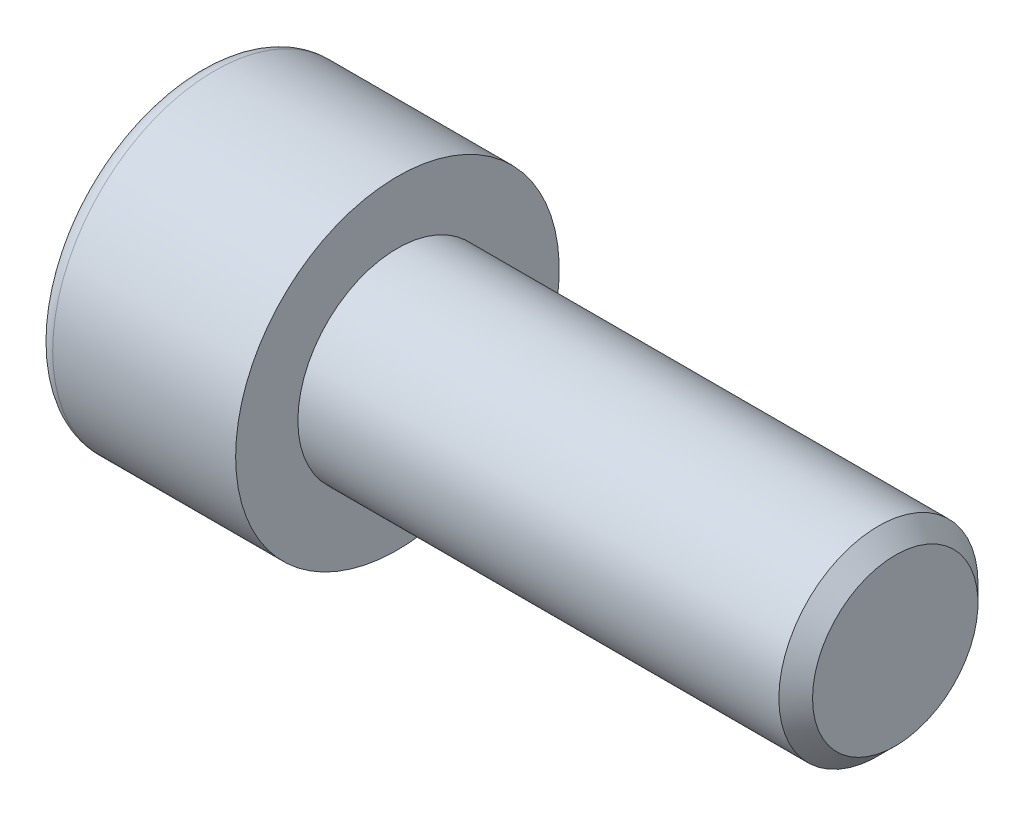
ISO-10303-21;
HEADER;
FILE_DESCRIPTION(('STEP AP214'),'2;1');
FILE_NAME('part.step','',(''),(''),'','','');
FILE_SCHEMA(('AUTOMOTIVE_DESIGN { 1 0 10303 214 1 1 1 1 }'));
ENDSEC;
DATA;
#1=APPLICATION_CONTEXT('core data for automotive mechanical design processes');
#2=APPLICATION_PROTOCOL_DEFINITION('international standard','automotive_design',2000,#1);
#3=PRODUCT_CONTEXT('',#1,'mechanical');
#4=PRODUCT('Part','Part','',(#3));
#5=PRODUCT_RELATED_PRODUCT_CATEGORY('part','',(#4));
#6=PRODUCT_DEFINITION_FORMATION('','',#4);
#7=PRODUCT_DEFINITION_CONTEXT('part definition',#1,'design');
#8=PRODUCT_DEFINITION('design','',#6,#7);
#9=PRODUCT_DEFINITION_SHAPE('','',#8);
#10=(LENGTH_UNIT() NAMED_UNIT(*) SI_UNIT(.MILLI.,.METRE.));
#11=(NAMED_UNIT(*) PLANE_ANGLE_UNIT() SI_UNIT($,.RADIAN.));
#12=(NAMED_UNIT(*) SI_UNIT($,.STERADIAN.) SOLID_ANGLE_UNIT());
#13=UNCERTAINTY_MEASURE_WITH_UNIT(LENGTH_MEASURE(1.E-05),#10,'distance_accuracy_value','');
#14=(GEOMETRIC_REPRESENTATION_CONTEXT(3) GLOBAL_UNCERTAINTY_ASSIGNED_CONTEXT((#13)) GLOBAL_UNIT_ASSIGNED_CONTEXT((#10,
#11,#12)) REPRESENTATION_CONTEXT('',''));
#15=CARTESIAN_POINT('',(0.,0.,0.));
#16=DIRECTION('',(0.,0.,1.));
#17=DIRECTION('',(1.,0.,0.));
#18=AXIS2_PLACEMENT_3D('',#15,#16,#17);
#19=CARTESIAN_POINT('',(0.,0.,0.));
#20=DIRECTION('',(-0.999999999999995,0.,0.));
#21=DIRECTION('',(0.,0.,1.));
#22=AXIS2_PLACEMENT_3D('',#19,#20,#21);
#23=PLANE('',#22);
#24=CARTESIAN_POINT('',(0.,0.,0.));
#25=DIRECTION('',(-0.999999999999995,0.,0.));
#26=DIRECTION('',(0.,0.,1.));
#27=AXIS2_PLACEMENT_3D('',#24,#25,#26);
#28=CIRCLE('',#27,6.5);
#29=CARTESIAN_POINT('',(0.,0.,6.50000000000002));
#30=VERTEX_POINT('',#29);
#31=EDGE_CURVE('E117',#30,#30,#28,.T.);
#32=ORIENTED_EDGE('',*,*,#31,.F.);
#33=EDGE_LOOP('',(#32));
#34=FACE_BOUND('',#33,.T.);
#35=CARTESIAN_POINT('',(0.,0.,0.));
#36=DIRECTION('',(-0.999999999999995,0.,0.));
#37=DIRECTION('',(0.,0.,1.));
#38=AXIS2_PLACEMENT_3D('',#35,#36,#37);
#39=CIRCLE('',#38,4.);
#40=CARTESIAN_POINT('',(0.,0.,4.));
#41=VERTEX_POINT('',#40);
#42=EDGE_CURVE('E13',#41,#41,#39,.F.);
#43=ORIENTED_EDGE('',*,*,#42,.F.);
#44=EDGE_LOOP('',(#43));
#45=FACE_BOUND('',#44,.T.);
#46=ADVANCED_FACE('F24',(#34,#45),#23,.F.);
#47=CARTESIAN_POINT('',(-8.00000000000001,5.84999999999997,0.));
#48=DIRECTION('',(0.999999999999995,0.,0.));
#49=DIRECTION('',(0.,0.,-1.));
#50=AXIS2_PLACEMENT_3D('',#47,#48,#49);
#51=PLANE('',#50);
#52=CARTESIAN_POINT('',(-8.00000000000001,0.,0.));
#53=DIRECTION('',(-0.999999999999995,0.,0.));
#54=DIRECTION('',(0.,0.,1.));
#55=AXIS2_PLACEMENT_3D('',#52,#53,#54);
#56=CIRCLE('',#55,5.85);
#57=CARTESIAN_POINT('',(-8.00000000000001,0.,5.85000000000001));
#58=VERTEX_POINT('',#57);
#59=EDGE_CURVE('E99',#58,#58,#56,.T.);
#60=ORIENTED_EDGE('',*,*,#59,.T.);
#61=EDGE_LOOP('',(#60));
#62=FACE_BOUND('',#61,.T.);
#63=DIRECTION('',(0.,0.499999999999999,0.86602540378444));
#64=VECTOR('',#63,1.);
#65=CARTESIAN_POINT('',(-8.00000000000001,-1.13557621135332,4.0331243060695));
#66=LINE('',#65,#64);
#67=CARTESIAN_POINT('',(-8.00000000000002,-3.46410161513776,0.));
#68=VERTEX_POINT('',#67);
#69=CARTESIAN_POINT('',(-8.00000000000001,-1.73205080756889,3.00000000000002));
#70=VERTEX_POINT('',#69);
#71=EDGE_CURVE('E33',#68,#70,#66,.T.);
#72=ORIENTED_EDGE('',*,*,#71,.F.);
#73=DIRECTION('',(0.,-0.5,0.866025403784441));
#74=VECTOR('',#73,1.);
#75=CARTESIAN_POINT('',(-8.00000000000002,-1.13557621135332,-4.03312430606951));
#76=LINE('',#75,#74);
#77=CARTESIAN_POINT('',(-8.00000000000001,-1.73205080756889,-2.99999999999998));
#78=VERTEX_POINT('',#77);
#79=EDGE_CURVE('E48',#78,#68,#76,.T.);
#80=ORIENTED_EDGE('',*,*,#79,.F.);
#81=DIRECTION('',(0.,-1.,0.));
#82=VECTOR('',#81,1.);
#83=CARTESIAN_POINT('',(-8.00000000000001,5.84999999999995,-3.00000000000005));
#84=LINE('',#83,#82);
#85=CARTESIAN_POINT('',(-8.00000000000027,1.73205080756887,-3.00000000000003));
#86=VERTEX_POINT('',#85);
#87=EDGE_CURVE('E130',#86,#78,#84,.T.);
#88=ORIENTED_EDGE('',*,*,#87,.F.);
#89=DIRECTION('',(0.,-0.499999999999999,-0.866025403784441));
#90=VECTOR('',#89,1.);
#91=CARTESIAN_POINT('',(-8.00000000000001,4.0605762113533,1.03312430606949));
#92=LINE('',#91,#90);
#93=CARTESIAN_POINT('',(-8.00000000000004,3.46410161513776,0.));
#94=VERTEX_POINT('',#93);
#95=EDGE_CURVE('E127',#94,#86,#92,.T.);
#96=ORIENTED_EDGE('',*,*,#95,.F.);
#97=DIRECTION('',(0.,0.5,-0.866025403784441));
#98=VECTOR('',#97,1.);
#99=CARTESIAN_POINT('',(-8.00000000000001,4.06057621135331,-1.03312430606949));
#100=LINE('',#99,#98);
#101=CARTESIAN_POINT('',(-8.00000000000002,1.73205080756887,3.00000000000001));
#102=VERTEX_POINT('',#101);
#103=EDGE_CURVE('E124',#102,#94,#100,.T.);
#104=ORIENTED_EDGE('',*,*,#103,.F.);
#105=DIRECTION('',(0.,0.999999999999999,0.));
#106=VECTOR('',#105,1.);
#107=CARTESIAN_POINT('',(-8.00000000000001,5.84999999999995,3.00000000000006));
#108=LINE('',#107,#106);
#109=EDGE_CURVE('E121',#70,#102,#108,.T.);
#110=ORIENTED_EDGE('',*,*,#109,.F.);
#111=EDGE_LOOP('',(#72,#80,#88,#96,#104,#110));
#112=FACE_BOUND('',#111,.T.);
#113=ADVANCED_FACE('F26',(#62,#112),#51,.F.);
#114=CARTESIAN_POINT('',(-8.00000000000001,0.,0.));
#115=DIRECTION('',(-0.999999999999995,0.,0.));
#116=DIRECTION('',(0.,0.,1.));
#117=AXIS2_PLACEMENT_3D('',#114,#115,#116);
#118=CYLINDRICAL_SURFACE('',#117,6.5);
#119=CARTESIAN_POINT('',(-7.34999999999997,0.,0.));
#120=DIRECTION('',(-0.999999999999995,0.,0.));
#121=DIRECTION('',(0.,0.,1.));
#122=AXIS2_PLACEMENT_3D('',#119,#120,#121);
#123=CIRCLE('',#122,6.5);
#124=CARTESIAN_POINT('',(-7.34999999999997,0.,6.50000000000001));
#125=VERTEX_POINT('',#124);
#126=EDGE_CURVE('E107',#125,#125,#123,.T.);
#127=CARTESIAN_POINT('',(-7.34999999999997,0.,6.50000000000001));
#128=CARTESIAN_POINT('',(-7.27343749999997,0.,6.50000000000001));
#129=CARTESIAN_POINT('',(-7.19687499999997,0.,6.50000000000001));
#130=CARTESIAN_POINT('',(-7.04374999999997,0.,6.50000000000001));
#131=CARTESIAN_POINT('',(-6.96718749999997,0.,6.50000000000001));
#132=CARTESIAN_POINT('',(-6.81406249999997,0.,6.50000000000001));
#133=CARTESIAN_POINT('',(-6.73749999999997,0.,6.50000000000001));
#134=CARTESIAN_POINT('',(-6.58437499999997,0.,6.50000000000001));
#135=CARTESIAN_POINT('',(-6.50781249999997,0.,6.50000000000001));
#136=CARTESIAN_POINT('',(-6.35468749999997,0.,6.50000000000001));
#137=CARTESIAN_POINT('',(-6.27812499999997,0.,6.50000000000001));
#138=CARTESIAN_POINT('',(-6.12499999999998,0.,6.50000000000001));
#139=CARTESIAN_POINT('',(-6.04843749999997,0.,6.50000000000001));
#140=CARTESIAN_POINT('',(-5.89531249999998,0.,6.50000000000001));
#141=CARTESIAN_POINT('',(-5.81874999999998,0.,6.50000000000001));
#142=CARTESIAN_POINT('',(-5.66562499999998,0.,6.50000000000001));
#143=CARTESIAN_POINT('',(-5.58906249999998,0.,6.50000000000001));
#144=CARTESIAN_POINT('',(-5.43593749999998,0.,6.50000000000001));
#145=CARTESIAN_POINT('',(-5.35937499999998,0.,6.50000000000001));
#146=CARTESIAN_POINT('',(-5.20624999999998,0.,6.50000000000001));
#147=CARTESIAN_POINT('',(-5.12968749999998,0.,6.50000000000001));
#148=CARTESIAN_POINT('',(-4.97656249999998,0.,6.50000000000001));
#149=CARTESIAN_POINT('',(-4.89999999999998,0.,6.50000000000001));
#150=CARTESIAN_POINT('',(-4.74687499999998,0.,6.50000000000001));
#151=CARTESIAN_POINT('',(-4.67031249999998,0.,6.50000000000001));
#152=CARTESIAN_POINT('',(-4.51718749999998,0.,6.50000000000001));
#153=CARTESIAN_POINT('',(-4.44062499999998,0.,6.50000000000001));
#154=CARTESIAN_POINT('',(-4.28749999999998,0.,6.50000000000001));
#155=CARTESIAN_POINT('',(-4.21093749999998,0.,6.50000000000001));
#156=CARTESIAN_POINT('',(-4.05781249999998,0.,6.50000000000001));
#157=CARTESIAN_POINT('',(-3.98124999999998,0.,6.50000000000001));
#158=CARTESIAN_POINT('',(-3.82812499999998,0.,6.50000000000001));
#159=CARTESIAN_POINT('',(-3.75156249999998,0.,6.50000000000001));
#160=CARTESIAN_POINT('',(-3.59843749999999,0.,6.50000000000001));
#161=CARTESIAN_POINT('',(-3.52187499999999,0.,6.50000000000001));
#162=CARTESIAN_POINT('',(-3.36874999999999,0.,6.50000000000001));
#163=CARTESIAN_POINT('',(-3.29218749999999,0.,6.50000000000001));
#164=CARTESIAN_POINT('',(-3.13906249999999,0.,6.50000000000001));
#165=CARTESIAN_POINT('',(-3.06249999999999,0.,6.50000000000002));
#166=CARTESIAN_POINT('',(-2.90937499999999,0.,6.50000000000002));
#167=CARTESIAN_POINT('',(-2.83281249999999,0.,6.50000000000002));
#168=CARTESIAN_POINT('',(-2.67968749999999,0.,6.50000000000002));
#169=CARTESIAN_POINT('',(-2.60312499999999,0.,6.50000000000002));
#170=CARTESIAN_POINT('',(-2.44999999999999,0.,6.50000000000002));
#171=CARTESIAN_POINT('',(-2.37343749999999,0.,6.50000000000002));
#172=CARTESIAN_POINT('',(-2.22031249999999,0.,6.50000000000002));
#173=CARTESIAN_POINT('',(-2.14374999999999,0.,6.50000000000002));
#174=CARTESIAN_POINT('',(-1.99062499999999,0.,6.50000000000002));
#175=CARTESIAN_POINT('',(-1.91406249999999,0.,6.50000000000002));
#176=CARTESIAN_POINT('',(-1.76093749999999,0.,6.50000000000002));
#177=CARTESIAN_POINT('',(-1.68437499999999,0.,6.50000000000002));
#178=CARTESIAN_POINT('',(-1.53124999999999,0.,6.50000000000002));
#179=CARTESIAN_POINT('',(-1.4546875,0.,6.50000000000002));
#180=CARTESIAN_POINT('',(-1.3015625,0.,6.50000000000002));
#181=CARTESIAN_POINT('',(-1.225,0.,6.50000000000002));
#182=CARTESIAN_POINT('',(-1.071875,0.,6.50000000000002));
#183=CARTESIAN_POINT('',(-0.995312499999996,0.,6.50000000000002));
#184=CARTESIAN_POINT('',(-0.842187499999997,0.,6.50000000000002));
#185=CARTESIAN_POINT('',(-0.765624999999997,0.,6.50000000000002));
#186=CARTESIAN_POINT('',(-0.612499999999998,0.,6.50000000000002));
#187=CARTESIAN_POINT('',(-0.535937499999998,0.,6.50000000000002));
#188=CARTESIAN_POINT('',(-0.382812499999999,0.,6.50000000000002));
#189=CARTESIAN_POINT('',(-0.30625,0.,6.50000000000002));
#190=CARTESIAN_POINT('',(-0.153125,0.,6.50000000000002));
#191=CARTESIAN_POINT('',(-0.0765625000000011,0.,6.50000000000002));
#192=CARTESIAN_POINT('',(0.,0.,6.50000000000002));
#193=B_SPLINE_CURVE_WITH_KNOTS('',3,(#127,#128,#129,#130,#131,#132,#133,#134,#135,#136,#137,
#138,#139,#140,#141,#142,#143,#144,#145,#146,#147,#148,#149,#150,#151,#152,#153,#154,#155,#156,
#157,#158,#159,#160,#161,#162,#163,#164,#165,#166,#167,#168,#169,#170,#171,#172,#173,#174,#175,
#176,#177,#178,#179,#180,#181,#182,#183,#184,#185,#186,#187,#188,#189,#190,#191,#192),
.UNSPECIFIED.,.F.,.F.,(4,2,2,2,2,2,2,2,2,2,2,2,2,2,2,2,2,2,2,2,2,2,2,2,2,2,2,2,2,2,2,2,4),(0.,
0.229687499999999,0.459374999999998,0.689062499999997,0.918749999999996,1.14843749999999,
1.37812499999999,1.60781249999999,1.83749999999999,2.06718749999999,2.29687499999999,
2.52656249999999,2.75624999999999,2.98593749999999,3.21562499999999,3.44531249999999,
3.67499999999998,3.90468749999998,4.13437499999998,4.36406249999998,4.59374999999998,
4.82343749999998,5.05312499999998,5.28281249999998,5.51249999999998,5.74218749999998,
5.97187499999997,6.20156249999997,6.43124999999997,6.66093749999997,6.89062499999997,
7.12031249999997,7.34999999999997),.UNSPECIFIED.);
#194=EDGE_CURVE('BSEAM216',#125,#30,#193,.T.);
#195=ORIENTED_EDGE('',*,*,#126,.F.);
#196=ORIENTED_EDGE('',*,*,#31,.T.);
#197=ORIENTED_EDGE('',*,*,#194,.T.);
#198=ORIENTED_EDGE('',*,*,#194,.F.);
#199=EDGE_LOOP('',(#195,#197,#196,#198));
#200=FACE_BOUND('',#199,.T.);
#201=ADVANCED_FACE('F216',(#200),#118,.T.);
#202=CARTESIAN_POINT('',(-7.34999999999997,0.,0.));
#203=DIRECTION('',(-0.999999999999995,0.,0.));
#204=DIRECTION('',(0.,0.,1.));
#205=AXIS2_PLACEMENT_3D('',#202,#203,#204);
#206=TOROIDAL_SURFACE('',#205,5.85,0.65);
#207=ORIENTED_EDGE('',*,*,#59,.F.);
#208=EDGE_LOOP('',(#207));
#209=FACE_BOUND('',#208,.T.);
#210=ORIENTED_EDGE('',*,*,#126,.T.);
#211=EDGE_LOOP('',(#210));
#212=FACE_BOUND('',#211,.T.);
#213=ADVANCED_FACE('F223',(#209,#212),#206,.T.);
#214=CARTESIAN_POINT('',(-3.99999999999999,-1.73205080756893,3.00000000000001));
#215=DIRECTION('',(0.,0.866025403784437,-0.500000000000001));
#216=DIRECTION('',(0.,0.499999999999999,0.86602540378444));
#217=AXIS2_PLACEMENT_3D('',#214,#215,#216);
#218=PLANE('',#217);
#219=ORIENTED_EDGE('',*,*,#71,.T.);
#220=DIRECTION('',(-0.999999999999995,0.,0.));
#221=VECTOR('',#220,1.);
#222=CARTESIAN_POINT('',(-3.99999999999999,-1.73205080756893,3.00000000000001));
#223=LINE('',#222,#221);
#224=CARTESIAN_POINT('',(-3.99999999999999,-1.73205080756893,3.00000000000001));
#225=VERTEX_POINT('',#224);
#226=EDGE_CURVE('E40',#225,#70,#223,.T.);
#227=ORIENTED_EDGE('',*,*,#226,.F.);
#228=DIRECTION('',(0.,-0.499999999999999,-0.86602540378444));
#229=VECTOR('',#228,1.);
#230=CARTESIAN_POINT('',(-3.99999999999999,-1.73205080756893,3.00000000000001));
#231=LINE('',#230,#229);
#232=CARTESIAN_POINT('',(-4.00000000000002,-3.46410161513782,0.));
#233=VERTEX_POINT('',#232);
#234=EDGE_CURVE('E84',#225,#233,#231,.T.);
#235=ORIENTED_EDGE('',*,*,#234,.T.);
#236=DIRECTION('',(-0.999999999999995,0.,0.));
#237=VECTOR('',#236,1.);
#238=CARTESIAN_POINT('',(-4.00000000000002,-3.46410161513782,0.));
#239=LINE('',#238,#237);
#240=EDGE_CURVE('E92',#233,#68,#239,.T.);
#241=ORIENTED_EDGE('',*,*,#240,.T.);
#242=EDGE_LOOP('',(#219,#227,#235,#241));
#243=FACE_BOUND('',#242,.T.);
#244=ADVANCED_FACE('F91',(#243),#218,.T.);
#245=CARTESIAN_POINT('',(-4.00000000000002,-3.46410161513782,0.));
#246=DIRECTION('',(0.,0.866025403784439,0.500000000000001));
#247=DIRECTION('',(0.,-0.5,0.866025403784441));
#248=AXIS2_PLACEMENT_3D('',#245,#246,#247);
#249=PLANE('',#248);
#250=ORIENTED_EDGE('',*,*,#79,.T.);
#251=ORIENTED_EDGE('',*,*,#240,.F.);
#252=DIRECTION('',(0.,0.5,-0.866025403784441));
#253=VECTOR('',#252,1.);
#254=CARTESIAN_POINT('',(-4.00000000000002,-3.46410161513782,0.));
#255=LINE('',#254,#253);
#256=CARTESIAN_POINT('',(-4.,-1.73205080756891,-2.99999999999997));
#257=VERTEX_POINT('',#256);
#258=EDGE_CURVE('E80',#233,#257,#255,.T.);
#259=ORIENTED_EDGE('',*,*,#258,.T.);
#260=DIRECTION('',(-0.999999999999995,0.,0.));
#261=VECTOR('',#260,1.);
#262=CARTESIAN_POINT('',(-4.,-1.73205080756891,-2.99999999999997));
#263=LINE('',#262,#261);
#264=EDGE_CURVE('E100',#257,#78,#263,.T.);
#265=ORIENTED_EDGE('',*,*,#264,.T.);
#266=EDGE_LOOP('',(#250,#251,#259,#265));
#267=FACE_BOUND('',#266,.T.);
#268=ADVANCED_FACE('F97',(#267),#249,.T.);
#269=CARTESIAN_POINT('',(-4.,-1.73205080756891,-2.99999999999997));
#270=DIRECTION('',(0.,0.,1.));
#271=DIRECTION('',(0.,-1.,0.));
#272=AXIS2_PLACEMENT_3D('',#269,#270,#271);
#273=PLANE('',#272);
#274=ORIENTED_EDGE('',*,*,#87,.T.);
#275=ORIENTED_EDGE('',*,*,#264,.F.);
#276=DIRECTION('',(0.,1.,0.));
#277=VECTOR('',#276,1.);
#278=CARTESIAN_POINT('',(-4.,-1.73205080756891,-2.99999999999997));
#279=LINE('',#278,#277);
#280=CARTESIAN_POINT('',(-4.00000000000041,1.73205080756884,-3.00000000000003));
#281=VERTEX_POINT('',#280);
#282=EDGE_CURVE('E86',#257,#281,#279,.T.);
#283=ORIENTED_EDGE('',*,*,#282,.T.);
#284=DIRECTION('',(-0.999999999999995,0.,0.));
#285=VECTOR('',#284,1.);
#286=CARTESIAN_POINT('',(-4.00000000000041,1.73205080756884,-3.00000000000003));
#287=LINE('',#286,#285);
#288=EDGE_CURVE('E110',#281,#86,#287,.T.);
#289=ORIENTED_EDGE('',*,*,#288,.T.);
#290=EDGE_LOOP('',(#274,#275,#283,#289));
#291=FACE_BOUND('',#290,.T.);
#292=ADVANCED_FACE('F169',(#291),#273,.T.);
#293=CARTESIAN_POINT('',(-4.00000000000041,1.73205080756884,-3.00000000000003));
#294=DIRECTION('',(0.,-0.866025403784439,0.500000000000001));
#295=DIRECTION('',(0.,-0.499999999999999,-0.866025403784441));
#296=AXIS2_PLACEMENT_3D('',#293,#294,#295);
#297=PLANE('',#296);
#298=ORIENTED_EDGE('',*,*,#95,.T.);
#299=ORIENTED_EDGE('',*,*,#288,.F.);
#300=DIRECTION('',(0.,0.499999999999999,0.866025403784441));
#301=VECTOR('',#300,1.);
#302=CARTESIAN_POINT('',(-4.00000000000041,1.73205080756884,-3.00000000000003));
#303=LINE('',#302,#301);
#304=CARTESIAN_POINT('',(-4.00000000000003,3.46410161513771,0.));
#305=VERTEX_POINT('',#304);
#306=EDGE_CURVE('E172',#281,#305,#303,.T.);
#307=ORIENTED_EDGE('',*,*,#306,.T.);
#308=DIRECTION('',(-0.999999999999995,0.,0.));
#309=VECTOR('',#308,1.);
#310=CARTESIAN_POINT('',(-4.00000000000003,3.46410161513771,0.));
#311=LINE('',#310,#309);
#312=EDGE_CURVE('E151',#305,#94,#311,.T.);
#313=ORIENTED_EDGE('',*,*,#312,.T.);
#314=EDGE_LOOP('',(#298,#299,#307,#313));
#315=FACE_BOUND('',#314,.T.);
#316=ADVANCED_FACE('F171',(#315),#297,.T.);
#317=CARTESIAN_POINT('',(-4.00000000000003,3.46410161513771,0.));
#318=DIRECTION('',(0.,-0.866025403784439,-0.500000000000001));
#319=DIRECTION('',(0.,0.5,-0.866025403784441));
#320=AXIS2_PLACEMENT_3D('',#317,#318,#319);
#321=PLANE('',#320);
#322=ORIENTED_EDGE('',*,*,#103,.T.);
#323=ORIENTED_EDGE('',*,*,#312,.F.);
#324=DIRECTION('',(0.,-0.5,0.866025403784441));
#325=VECTOR('',#324,1.);
#326=CARTESIAN_POINT('',(-4.00000000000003,3.46410161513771,0.));
#327=LINE('',#326,#325);
#328=CARTESIAN_POINT('',(-4.00000000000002,1.73205080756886,3.00000000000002));
#329=VERTEX_POINT('',#328);
#330=EDGE_CURVE('E149',#305,#329,#327,.T.);
#331=ORIENTED_EDGE('',*,*,#330,.T.);
#332=DIRECTION('',(-0.999999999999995,0.,0.));
#333=VECTOR('',#332,1.);
#334=CARTESIAN_POINT('',(-4.00000000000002,1.73205080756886,3.00000000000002));
#335=LINE('',#334,#333);
#336=EDGE_CURVE('E143',#329,#102,#335,.T.);
#337=ORIENTED_EDGE('',*,*,#336,.T.);
#338=EDGE_LOOP('',(#322,#323,#331,#337));
#339=FACE_BOUND('',#338,.T.);
#340=ADVANCED_FACE('F145',(#339),#321,.T.);
#341=CARTESIAN_POINT('',(-4.00000000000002,1.73205080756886,3.00000000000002));
#342=DIRECTION('',(0.,0.,-1.));
#343=DIRECTION('',(0.,0.999999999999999,0.));
#344=AXIS2_PLACEMENT_3D('',#341,#342,#343);
#345=PLANE('',#344);
#346=ORIENTED_EDGE('',*,*,#109,.T.);
#347=ORIENTED_EDGE('',*,*,#336,.F.);
#348=DIRECTION('',(0.,-0.999999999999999,0.));
#349=VECTOR('',#348,1.);
#350=CARTESIAN_POINT('',(-4.00000000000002,1.73205080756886,3.00000000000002));
#351=LINE('',#350,#349);
#352=EDGE_CURVE('E159',#329,#225,#351,.T.);
#353=ORIENTED_EDGE('',*,*,#352,.T.);
#354=ORIENTED_EDGE('',*,*,#226,.T.);
#355=EDGE_LOOP('',(#346,#347,#353,#354));
#356=FACE_BOUND('',#355,.T.);
#357=ADVANCED_FACE('F142',(#356),#345,.T.);
#358=CARTESIAN_POINT('',(-4.00000000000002,-3.46410161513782,0.));
#359=DIRECTION('',(0.999999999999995,0.,0.));
#360=DIRECTION('',(0.,0.,1.));
#361=AXIS2_PLACEMENT_3D('',#358,#359,#360);
#362=PLANE('',#361);
#363=ORIENTED_EDGE('',*,*,#234,.F.);
#364=ORIENTED_EDGE('',*,*,#352,.F.);
#365=ORIENTED_EDGE('',*,*,#330,.F.);
#366=ORIENTED_EDGE('',*,*,#306,.F.);
#367=ORIENTED_EDGE('',*,*,#282,.F.);
#368=ORIENTED_EDGE('',*,*,#258,.F.);
#369=EDGE_LOOP('',(#363,#364,#365,#366,#367,#368));
#370=FACE_BOUND('',#369,.T.);
#371=ADVANCED_FACE('F82',(#370),#362,.F.);
#372=CARTESIAN_POINT('',(0.,0.,0.));
#373=DIRECTION('',(-0.999999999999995,0.,0.));
#374=DIRECTION('',(0.,0.,1.));
#375=AXIS2_PLACEMENT_3D('',#372,#373,#374);
#376=CYLINDRICAL_SURFACE('',#375,4.);
#377=CARTESIAN_POINT('',(19.3234375,0.,0.));
#378=DIRECTION('',(-0.999999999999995,0.,0.));
#379=DIRECTION('',(0.,0.,1.));
#380=AXIS2_PLACEMENT_3D('',#377,#378,#379);
#381=CIRCLE('',#380,4.);
#382=CARTESIAN_POINT('',(19.3234375,0.,4.00000000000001));
#383=VERTEX_POINT('',#382);
#384=EDGE_CURVE('E185',#383,#383,#381,.T.);
#385=CARTESIAN_POINT('',(19.3234375,0.,4.00000000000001));
#386=CARTESIAN_POINT('',(19.1221516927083,0.,4.00000000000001));
#387=CARTESIAN_POINT('',(18.9208658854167,0.,4.00000000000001));
#388=CARTESIAN_POINT('',(18.5182942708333,0.,4.00000000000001));
#389=CARTESIAN_POINT('',(18.3170084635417,0.,4.00000000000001));
#390=CARTESIAN_POINT('',(17.9144368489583,0.,4.00000000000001));
#391=CARTESIAN_POINT('',(17.7131510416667,0.,4.00000000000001));
#392=CARTESIAN_POINT('',(17.3105794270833,0.,4.00000000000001));
#393=CARTESIAN_POINT('',(17.1092936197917,0.,4.00000000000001));
#394=CARTESIAN_POINT('',(16.7067220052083,0.,4.00000000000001));
#395=CARTESIAN_POINT('',(16.5054361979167,0.,4.00000000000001));
#396=CARTESIAN_POINT('',(16.1028645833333,0.,4.00000000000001));
#397=CARTESIAN_POINT('',(15.9015787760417,0.,4.00000000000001));
#398=CARTESIAN_POINT('',(15.4990071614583,0.,4.00000000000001));
#399=CARTESIAN_POINT('',(15.2977213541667,0.,4.00000000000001));
#400=CARTESIAN_POINT('',(14.8951497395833,0.,4.00000000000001));
#401=CARTESIAN_POINT('',(14.6938639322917,0.,4.00000000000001));
#402=CARTESIAN_POINT('',(14.2912923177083,0.,4.00000000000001));
#403=CARTESIAN_POINT('',(14.0900065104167,0.,4.00000000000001));
#404=CARTESIAN_POINT('',(13.6874348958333,0.,4.00000000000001));
#405=CARTESIAN_POINT('',(13.4861490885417,0.,4.00000000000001));
#406=CARTESIAN_POINT('',(13.0835774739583,0.,4.00000000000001));
#407=CARTESIAN_POINT('',(12.8822916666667,0.,4.00000000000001));
#408=CARTESIAN_POINT('',(12.4797200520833,0.,4.00000000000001));
#409=CARTESIAN_POINT('',(12.2784342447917,0.,4.00000000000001));
#410=CARTESIAN_POINT('',(11.8758626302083,0.,4.00000000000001));
#411=CARTESIAN_POINT('',(11.6745768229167,0.,4.00000000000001));
#412=CARTESIAN_POINT('',(11.2720052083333,0.,4.00000000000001));
#413=CARTESIAN_POINT('',(11.0707194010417,0.,4.00000000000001));
#414=CARTESIAN_POINT('',(10.6681477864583,0.,4.00000000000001));
#415=CARTESIAN_POINT('',(10.4668619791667,0.,4.00000000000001));
#416=CARTESIAN_POINT('',(10.0642903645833,0.,4.00000000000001));
#417=CARTESIAN_POINT('',(9.86300455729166,0.,4.00000000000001));
#418=CARTESIAN_POINT('',(9.46043294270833,0.,4.00000000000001));
#419=CARTESIAN_POINT('',(9.25914713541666,0.,4.00000000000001));
#420=CARTESIAN_POINT('',(8.85657552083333,0.,4.00000000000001));
#421=CARTESIAN_POINT('',(8.65528971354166,0.,4.00000000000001));
#422=CARTESIAN_POINT('',(8.25271809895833,0.,4.00000000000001));
#423=CARTESIAN_POINT('',(8.05143229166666,0.,4.00000000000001));
#424=CARTESIAN_POINT('',(7.64886067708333,0.,4.00000000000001));
#425=CARTESIAN_POINT('',(7.44757486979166,0.,4.00000000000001));
#426=CARTESIAN_POINT('',(7.04500325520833,0.,4.00000000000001));
#427=CARTESIAN_POINT('',(6.84371744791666,0.,4.00000000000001));
#428=CARTESIAN_POINT('',(6.44114583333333,0.,4.00000000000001));
#429=CARTESIAN_POINT('',(6.23986002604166,0.,4.00000000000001));
#430=CARTESIAN_POINT('',(5.83728841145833,0.,4.00000000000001));
#431=CARTESIAN_POINT('',(5.63600260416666,0.,4.00000000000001));
#432=CARTESIAN_POINT('',(5.23343098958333,0.,4.00000000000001));
#433=CARTESIAN_POINT('',(5.03214518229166,0.,4.00000000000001));
#434=CARTESIAN_POINT('',(4.62957356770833,0.,4.00000000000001));
#435=CARTESIAN_POINT('',(4.42828776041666,0.,4.00000000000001));
#436=CARTESIAN_POINT('',(4.02571614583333,0.,4.00000000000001));
#437=CARTESIAN_POINT('',(3.82443033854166,0.,4.00000000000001));
#438=CARTESIAN_POINT('',(3.42185872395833,0.,4.00000000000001));
#439=CARTESIAN_POINT('',(3.22057291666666,0.,4.00000000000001));
#440=CARTESIAN_POINT('',(2.81800130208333,0.,4.00000000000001));
#441=CARTESIAN_POINT('',(2.61671549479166,0.,4.00000000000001));
#442=CARTESIAN_POINT('',(2.21414388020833,0.,4.00000000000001));
#443=CARTESIAN_POINT('',(2.01285807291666,0.,4.00000000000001));
#444=CARTESIAN_POINT('',(1.61028645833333,0.,4.00000000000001));
#445=CARTESIAN_POINT('',(1.40900065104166,0.,4.));
#446=CARTESIAN_POINT('',(1.00642903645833,0.,4.));
#447=CARTESIAN_POINT('',(0.805143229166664,0.,4.));
#448=CARTESIAN_POINT('',(0.402571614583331,0.,4.));
#449=CARTESIAN_POINT('',(0.201285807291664,0.,4.));
#450=CARTESIAN_POINT('',(0.,0.,4.));
#451=B_SPLINE_CURVE_WITH_KNOTS('',3,(#385,#386,#387,#388,#389,#390,#391,#392,#393,#394,#395,
#396,#397,#398,#399,#400,#401,#402,#403,#404,#405,#406,#407,#408,#409,#410,#411,#412,#413,#414,
#415,#416,#417,#418,#419,#420,#421,#422,#423,#424,#425,#426,#427,#428,#429,#430,#431,#432,#433,
#434,#435,#436,#437,#438,#439,#440,#441,#442,#443,#444,#445,#446,#447,#448,#449,#450),
.UNSPECIFIED.,.F.,.F.,(4,2,2,2,2,2,2,2,2,2,2,2,2,2,2,2,2,2,2,2,2,2,2,2,2,2,2,2,2,2,2,2,4),(0.,
0.603857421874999,1.20771484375,1.811572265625,2.4154296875,3.019287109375,3.62314453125,
4.227001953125,4.830859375,5.43471679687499,6.03857421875,6.64243164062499,7.24628906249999,
7.85014648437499,8.45400390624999,9.05786132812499,9.66171874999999,10.265576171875,
10.86943359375,11.473291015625,12.0771484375,12.681005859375,13.28486328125,13.888720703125,
14.492578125,15.096435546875,15.70029296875,16.304150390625,16.9080078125,17.511865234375,
18.11572265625,18.719580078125,19.3234375),.UNSPECIFIED.);
#452=EDGE_CURVE('BSEAM193',#383,#41,#451,.T.);
#453=ORIENTED_EDGE('',*,*,#384,.T.);
#454=ORIENTED_EDGE('',*,*,#42,.T.);
#455=ORIENTED_EDGE('',*,*,#452,.T.);
#456=ORIENTED_EDGE('',*,*,#452,.F.);
#457=EDGE_LOOP('',(#453,#455,#454,#456));
#458=FACE_BOUND('',#457,.T.);
#459=ADVANCED_FACE('F193',(#458),#376,.T.);
#460=CARTESIAN_POINT('',(20.,0.,0.));
#461=DIRECTION('',(-0.999999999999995,0.,0.));
#462=DIRECTION('',(0.,0.,1.));
#463=AXIS2_PLACEMENT_3D('',#460,#461,#462);
#464=PLANE('',#463);
#465=CARTESIAN_POINT('',(20.,0.,0.));
#466=DIRECTION('',(-0.999999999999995,0.,0.));
#467=DIRECTION('',(0.,0.,1.));
#468=AXIS2_PLACEMENT_3D('',#465,#466,#467);
#469=CIRCLE('',#468,3.3234375);
#470=CARTESIAN_POINT('',(20.,0.,3.32343749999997));
#471=VERTEX_POINT('',#470);
#472=EDGE_CURVE('E95',#471,#471,#469,.T.);
#473=ORIENTED_EDGE('',*,*,#472,.F.);
#474=EDGE_LOOP('',(#473));
#475=FACE_BOUND('',#474,.T.);
#476=ADVANCED_FACE('F199',(#475),#464,.F.);
#477=CARTESIAN_POINT('',(20.,0.,0.));
#478=DIRECTION('',(-0.999999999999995,0.,0.));
#479=DIRECTION('',(0.,0.,1.));
#480=AXIS2_PLACEMENT_3D('',#477,#478,#479);
#481=CONICAL_SURFACE('',#480,3.3234375,0.78539816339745);
#482=CARTESIAN_POINT('',(19.3234375,0.,4.00000000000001));
#483=CARTESIAN_POINT('',(19.3304850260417,0.,3.99295247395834));
#484=CARTESIAN_POINT('',(19.3375325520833,0.,3.98590494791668));
#485=CARTESIAN_POINT('',(19.3516276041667,0.,3.97180989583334));
#486=CARTESIAN_POINT('',(19.3586751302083,0.,3.96476236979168));
#487=CARTESIAN_POINT('',(19.3727701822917,0.,3.95066731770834));
#488=CARTESIAN_POINT('',(19.3798177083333,0.,3.94361979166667));
#489=CARTESIAN_POINT('',(19.3939127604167,0.,3.92952473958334));
#490=CARTESIAN_POINT('',(19.4009602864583,0.,3.92247721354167));
#491=CARTESIAN_POINT('',(19.4150553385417,0.,3.90838216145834));
#492=CARTESIAN_POINT('',(19.4221028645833,0.,3.90133463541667));
#493=CARTESIAN_POINT('',(19.4361979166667,0.,3.88723958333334));
#494=CARTESIAN_POINT('',(19.4432454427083,0.,3.88019205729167));
#495=CARTESIAN_POINT('',(19.4573404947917,0.,3.86609700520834));
#496=CARTESIAN_POINT('',(19.4643880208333,0.,3.85904947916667));
#497=CARTESIAN_POINT('',(19.4784830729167,0.,3.84495442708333));
#498=CARTESIAN_POINT('',(19.4855305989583,0.,3.83790690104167));
#499=CARTESIAN_POINT('',(19.4996256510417,0.,3.82381184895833));
#500=CARTESIAN_POINT('',(19.5066731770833,0.,3.81676432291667));
#501=CARTESIAN_POINT('',(19.5207682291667,0.,3.80266927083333));
#502=CARTESIAN_POINT('',(19.5278157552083,0.,3.79562174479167));
#503=CARTESIAN_POINT('',(19.5419108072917,0.,3.78152669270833));
#504=CARTESIAN_POINT('',(19.5489583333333,0.,3.77447916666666));
#505=CARTESIAN_POINT('',(19.5630533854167,0.,3.76038411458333));
#506=CARTESIAN_POINT('',(19.5701009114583,0.,3.75333658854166));
#507=CARTESIAN_POINT('',(19.5841959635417,0.,3.73924153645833));
#508=CARTESIAN_POINT('',(19.5912434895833,0.,3.73219401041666));
#509=CARTESIAN_POINT('',(19.6053385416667,0.,3.71809895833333));
#510=CARTESIAN_POINT('',(19.6123860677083,0.,3.71105143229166));
#511=CARTESIAN_POINT('',(19.6264811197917,0.,3.69695638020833));
#512=CARTESIAN_POINT('',(19.6335286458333,0.,3.68990885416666));
#513=CARTESIAN_POINT('',(19.6476236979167,0.,3.67581380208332));
#514=CARTESIAN_POINT('',(19.6546712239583,0.,3.66876627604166));
#515=CARTESIAN_POINT('',(19.6687662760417,0.,3.65467122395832));
#516=CARTESIAN_POINT('',(19.6758138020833,0.,3.64762369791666));
#517=CARTESIAN_POINT('',(19.6899088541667,0.,3.63352864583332));
#518=CARTESIAN_POINT('',(19.6969563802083,0.,3.62648111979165));
#519=CARTESIAN_POINT('',(19.7110514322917,0.,3.61238606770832));
#520=CARTESIAN_POINT('',(19.7180989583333,0.,3.60533854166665));
#521=CARTESIAN_POINT('',(19.7321940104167,0.,3.59124348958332));
#522=CARTESIAN_POINT('',(19.7392415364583,0.,3.58419596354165));
#523=CARTESIAN_POINT('',(19.7533365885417,0.,3.57010091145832));
#524=CARTESIAN_POINT('',(19.7603841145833,0.,3.56305338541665));
#525=CARTESIAN_POINT('',(19.7744791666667,0.,3.54895833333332));
#526=CARTESIAN_POINT('',(19.7815266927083,0.,3.54191080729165));
#527=CARTESIAN_POINT('',(19.7956217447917,0.,3.52781575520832));
#528=CARTESIAN_POINT('',(19.8026692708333,0.,3.52076822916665));
#529=CARTESIAN_POINT('',(19.8167643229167,0.,3.50667317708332));
#530=CARTESIAN_POINT('',(19.8238118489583,0.,3.49962565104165));
#531=CARTESIAN_POINT('',(19.8379069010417,0.,3.48553059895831));
#532=CARTESIAN_POINT('',(19.8449544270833,0.,3.47848307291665));
#533=CARTESIAN_POINT('',(19.8590494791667,0.,3.46438802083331));
#534=CARTESIAN_POINT('',(19.8660970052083,0.,3.45734049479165));
#535=CARTESIAN_POINT('',(19.8801920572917,0.,3.44324544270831));
#536=CARTESIAN_POINT('',(19.8872395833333,0.,3.43619791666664));
#537=CARTESIAN_POINT('',(19.9013346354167,0.,3.42210286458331));
#538=CARTESIAN_POINT('',(19.9083821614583,0.,3.41505533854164));
#539=CARTESIAN_POINT('',(19.9224772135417,0.,3.40096028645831));
#540=CARTESIAN_POINT('',(19.9295247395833,0.,3.39391276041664));
#541=CARTESIAN_POINT('',(19.9436197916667,0.,3.37981770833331));
#542=CARTESIAN_POINT('',(19.9506673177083,0.,3.37277018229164));
#543=CARTESIAN_POINT('',(19.9647623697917,0.,3.35867513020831));
#544=CARTESIAN_POINT('',(19.9718098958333,0.,3.35162760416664));
#545=CARTESIAN_POINT('',(19.9859049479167,0.,3.3375325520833));
#546=CARTESIAN_POINT('',(19.9929524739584,0.,3.33048502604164));
#547=CARTESIAN_POINT('',(20.,0.,3.32343749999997));
#548=B_SPLINE_CURVE_WITH_KNOTS('',3,(#482,#483,#484,#485,#486,#487,#488,#489,#490,#491,#492,
#493,#494,#495,#496,#497,#498,#499,#500,#501,#502,#503,#504,#505,#506,#507,#508,#509,#510,#511,
#512,#513,#514,#515,#516,#517,#518,#519,#520,#521,#522,#523,#524,#525,#526,#527,#528,#529,#530,
#531,#532,#533,#534,#535,#536,#537,#538,#539,#540,#541,#542,#543,#544,#545,#546,#547),
.UNSPECIFIED.,.F.,.F.,(4,2,2,2,2,2,2,2,2,2,2,2,2,2,2,2,2,2,2,2,2,2,2,2,2,2,2,2,2,2,2,2,4),(0.,
0.0299001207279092,0.0598002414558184,0.0897003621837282,0.119600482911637,0.149500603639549,
0.179400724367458,0.209300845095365,0.239200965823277,0.269101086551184,0.299001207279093,
0.328901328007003,0.358801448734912,0.388701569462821,0.418601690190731,0.44850181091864,
0.478401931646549,0.508302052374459,0.538202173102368,0.56810229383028,0.598002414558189,
0.627902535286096,0.657802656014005,0.687702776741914,0.717602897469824,0.747503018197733,
0.777403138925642,0.807303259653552,0.837203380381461,0.86710350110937,0.897003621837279,
0.926903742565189,0.956803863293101),.UNSPECIFIED.);
#549=EDGE_CURVE('BSEAM196',#383,#471,#548,.T.);
#550=ORIENTED_EDGE('',*,*,#384,.F.);
#551=ORIENTED_EDGE('',*,*,#472,.T.);
#552=ORIENTED_EDGE('',*,*,#549,.T.);
#553=ORIENTED_EDGE('',*,*,#549,.F.);
#554=EDGE_LOOP('',(#550,#552,#551,#553));
#555=FACE_BOUND('',#554,.T.);
#556=ADVANCED_FACE('F196',(#555),#481,.T.);
#557=CLOSED_SHELL('',(#46,#113,#201,#213,#244,#268,#292,#316,#340,#357,#371,#459,#476,#556));
#558=MANIFOLD_SOLID_BREP('B1',#557);
#559=ADVANCED_BREP_SHAPE_REPRESENTATION('',(#18,#558),#14);
#560=SHAPE_DEFINITION_REPRESENTATION(#9,#559);
ENDSEC;
END-ISO-10303-21;
